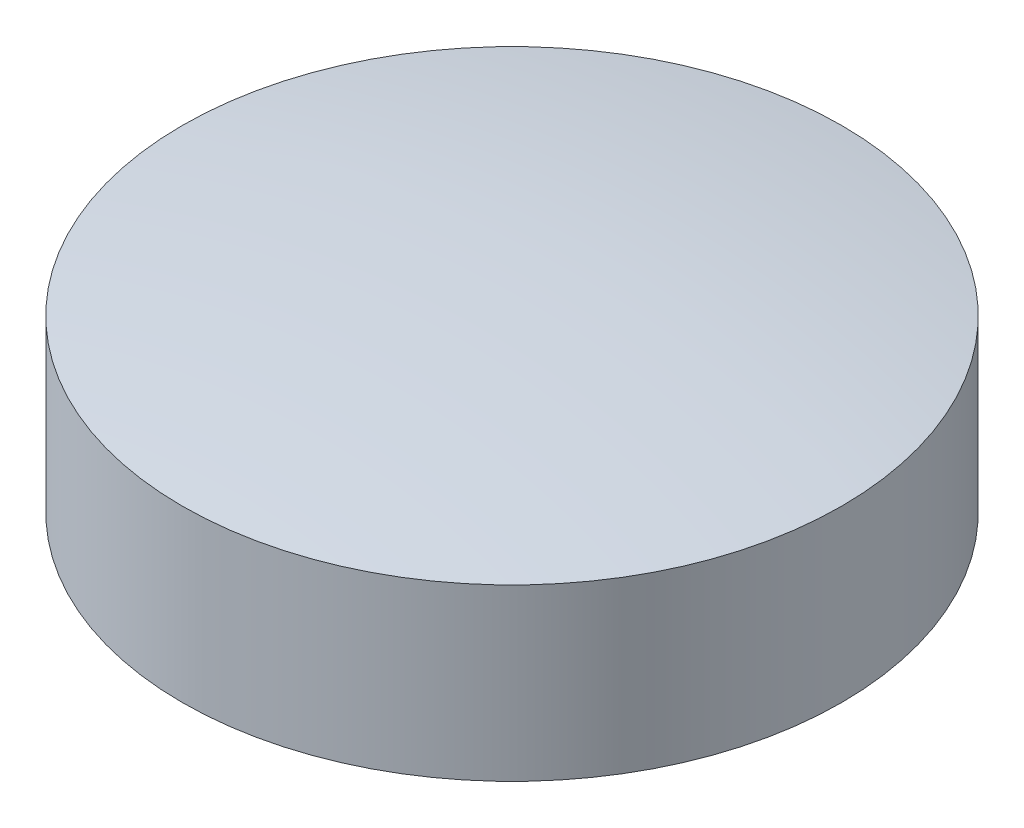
ISO-10303-21;
HEADER;
FILE_DESCRIPTION(('STEP AP214'),'2;1');
FILE_NAME('part.step','',(''),(''),'','','');
FILE_SCHEMA(('AUTOMOTIVE_DESIGN { 1 0 10303 214 1 1 1 1 }'));
ENDSEC;
DATA;
#1=APPLICATION_CONTEXT('core data for automotive mechanical design processes');
#2=APPLICATION_PROTOCOL_DEFINITION('international standard','automotive_design',2000,#1);
#3=PRODUCT_CONTEXT('',#1,'mechanical');
#4=PRODUCT('Part','Part','',(#3));
#5=PRODUCT_RELATED_PRODUCT_CATEGORY('part','',(#4));
#6=PRODUCT_DEFINITION_FORMATION('','',#4);
#7=PRODUCT_DEFINITION_CONTEXT('part definition',#1,'design');
#8=PRODUCT_DEFINITION('design','',#6,#7);
#9=PRODUCT_DEFINITION_SHAPE('','',#8);
#10=(LENGTH_UNIT() NAMED_UNIT(*) SI_UNIT(.MILLI.,.METRE.));
#11=(NAMED_UNIT(*) PLANE_ANGLE_UNIT() SI_UNIT($,.RADIAN.));
#12=(NAMED_UNIT(*) SI_UNIT($,.STERADIAN.) SOLID_ANGLE_UNIT());
#13=UNCERTAINTY_MEASURE_WITH_UNIT(LENGTH_MEASURE(1.E-05),#10,'distance_accuracy_value','');
#14=(GEOMETRIC_REPRESENTATION_CONTEXT(3) GLOBAL_UNCERTAINTY_ASSIGNED_CONTEXT((#13)) GLOBAL_UNIT_ASSIGNED_CONTEXT((#10,
#11,#12)) REPRESENTATION_CONTEXT('',''));
#15=CARTESIAN_POINT('',(0.,0.,0.));
#16=DIRECTION('',(0.,0.,1.));
#17=DIRECTION('',(1.,0.,0.));
#18=AXIS2_PLACEMENT_3D('',#15,#16,#17);
#19=CARTESIAN_POINT('',(0.,-90.0027589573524,177.59932375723));
#20=DIRECTION('',(0.,1.,0.));
#21=DIRECTION('',(0.,0.,1.));
#22=AXIS2_PLACEMENT_3D('',#19,#20,#21);
#23=CYLINDRICAL_SURFACE('',#22,25.);
#24=CARTESIAN_POINT('',(0.,-77.1033585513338,177.59932375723));
#25=DIRECTION('',(0.,1.,0.));
#26=DIRECTION('',(0.,0.,1.));
#27=AXIS2_PLACEMENT_3D('',#24,#25,#26);
#28=CIRCLE('',#27,25.);
#29=CARTESIAN_POINT('',(0.,-77.1033585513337,202.59932375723));
#30=VERTEX_POINT('',#29);
#31=EDGE_CURVE('E18',#30,#30,#28,.T.);
#32=ORIENTED_EDGE('',*,*,#31,.F.);
#33=EDGE_LOOP('',(#32));
#34=FACE_BOUND('',#33,.T.);
#35=CARTESIAN_POINT('',(0.,-90.0027589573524,177.59932375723));
#36=DIRECTION('',(0.,1.,0.));
#37=DIRECTION('',(0.,0.,1.));
#38=AXIS2_PLACEMENT_3D('',#35,#36,#37);
#39=CIRCLE('',#38,25.);
#40=CARTESIAN_POINT('',(0.,-90.0027589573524,202.59932375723));
#41=VERTEX_POINT('',#40);
#42=EDGE_CURVE('E9',#41,#41,#39,.T.);
#43=ORIENTED_EDGE('',*,*,#42,.T.);
#44=EDGE_LOOP('',(#43));
#45=FACE_BOUND('',#44,.T.);
#46=ADVANCED_FACE('F13',(#34,#45),#23,.T.);
#47=CARTESIAN_POINT('',(0.,-226.456887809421,177.59932375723));
#48=DIRECTION('',(0.,0.,1.));
#49=DIRECTION('',(0.,1.,0.));
#50=AXIS2_PLACEMENT_3D('',#47,#48,#49);
#51=SPHERICAL_SURFACE('',#50,151.431425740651);
#52=ORIENTED_EDGE('',*,*,#31,.T.);
#53=EDGE_LOOP('',(#52));
#54=FACE_BOUND('',#53,.T.);
#55=ADVANCED_FACE('F28',(#54),#51,.T.);
#56=CARTESIAN_POINT('',(0.,100.30109313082,177.59932375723));
#57=DIRECTION('',(0.,0.,1.));
#58=DIRECTION('',(0.,-1.,0.));
#59=AXIS2_PLACEMENT_3D('',#56,#57,#58);
#60=SPHERICAL_SURFACE('',#59,191.93893851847);
#61=ORIENTED_EDGE('',*,*,#42,.F.);
#62=EDGE_LOOP('',(#61));
#63=FACE_BOUND('',#62,.T.);
#64=ADVANCED_FACE('F15',(#63),#60,.T.);
#65=CLOSED_SHELL('',(#46,#55,#64));
#66=MANIFOLD_SOLID_BREP('B1',#65);
#67=ADVANCED_BREP_SHAPE_REPRESENTATION('',(#18,#66),#14);
#68=SHAPE_DEFINITION_REPRESENTATION(#9,#67);
ENDSEC;
END-ISO-10303-21;
